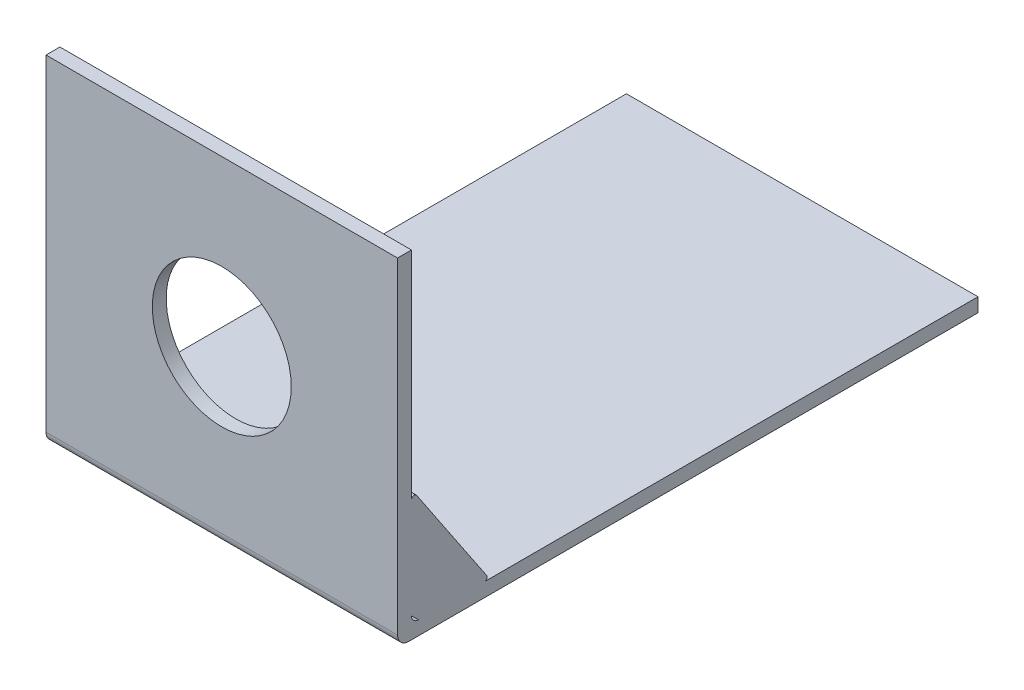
from build123d import *

# Parameters (mm, degrees)
BOSS_EXTRUDE1_DEPTH = 64.262
BOSS_EXTRUDE2_DEPTH = 2.54
CUT_EXTRUDE2_REACH  = 140.548
SKETCH6_R           = 12.7


with BuildPart() as part:
    # Sketch3 → Boss-Extrude1 (new body)
    with BuildSketch(Plane(origin=(0, 0, 0), x_dir=(0, 0, -1), z_dir=(1, 0, 0))):
        with BuildLine():
            Line((0, -59.69), (0, 0))
            Line((0, 0), (2.54, 0))
            Line((2.54, 0), (2.54, -57.912))
            ThreePointArc((2.54, -57.912), (2.911974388, -58.810025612), (3.81, -59.182))
            Line((3.81, -59.182), (106.0958, -59.182))
            Line((106.0958, -59.182), (106.0958, -61.722))
            Line((106.0958, -61.722), (2.032, -61.722))
            ThreePointArc((2.032, -61.722), (0.595159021, -61.126840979), (0, -59.69))
        make_face()
    extrude(amount=-BOSS_EXTRUDE1_DEPTH)

    # Sketch4 → Boss-Extrude2 (add)
    with BuildSketch(Plane(origin=(0, 0, 0), x_dir=(0, 0, -1), z_dir=(1, 0, 0))):
        with BuildLine():
            Line((3.81, -59.182), (15.87244967, -59.182))
            ThreePointArc((15.87244967, -59.182), (16.313631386, -58.917284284), (16.287662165, -58.403434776))
            Line((16.287662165, -58.403434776), (3.455212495, -39.276160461))
            ThreePointArc((3.455212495, -39.276160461), (2.89440853, -39.076391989), (2.54, -39.554725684))
            Line((2.54, -39.554725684), (2.54, -57.912))
            Line((2.54, -57.912), (3.81, -59.182))
        make_face()
    boss_extrude2 = extrude(amount=-BOSS_EXTRUDE2_DEPTH)

    # Mirror1: Boss-Extrude2 across plane
    add(boss_extrude2.mirror(Plane(origin=(-32.131, 0, 0), x_dir=(0, 0, 1), z_dir=(1, 0, 0))))

    # Sketch6 → Cut-Extrude2 (cut, up to next)
    with BuildSketch(Plane.XY, mode=Mode.PRIVATE) as cut_extrude2_sk1:
        with Locations((-32.131, -30.099)):
            Circle(SKETCH6_R)
    cut_extrude2_tool1 = extrude(cut_extrude2_sk1.sketch, amount=-CUT_EXTRUDE2_REACH, mode=Mode.PRIVATE) & part.part
    add(cut_extrude2_tool1.solids().sort_by_distance((-32.131, -30.099, 0))[0], mode=Mode.SUBTRACT)


solid = part.part
